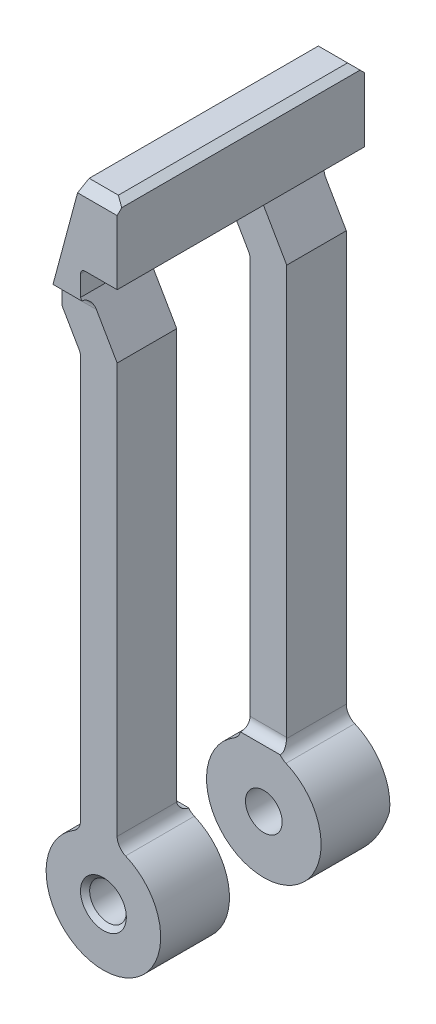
from build123d import *

# Parameters (mm, degrees)
ESQUISSE1_R             = 4
BASE_EXTRUSION_DEPTH    = 54
ENL_V_MAT_EXTRU_4_DEPTH = 25
CHANFREIN1_SIZE         = 1
CHANFREIN2_SIZE         = 2


with BuildPart() as part:
    # Esquisse1 → Base-Extrusion (new body)
    with BuildSketch(Plane.XY):
        with BuildLine():
            Line((-5, 13.275918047), (-5, 101.064101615))
            ThreePointArc((-5, 101.064101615), (-5.068148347, 101.581739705), (-5.267949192, 102.064101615))
            Line((-5.267949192, 102.064101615), (-9, 108.52820323))
            Line((-9, 108.52820323), (-9, 113.6))
            Line((-9, 113.6), (-3.105117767, 135.6))
            Line((-3.105117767, 135.6), (3.267949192, 135.6))
            Line((3.267949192, 135.6), (5, 134.6))
            Line((5, 134.6), (5, 119.6))
            Line((5, 119.6), (-2, 119.6))
            ThreePointArc((-2, 119.6), (-2.707106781, 119.307106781), (-3, 118.6))
            Line((-3, 118.6), (-3, 114.135898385))
            Line((-3, 114.135898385), (3, 103.743593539))
            Line((3, 103.743593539), (3, 14.291605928))
            ThreePointArc((3, 14.291605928), (3.501613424, 12.63086377), (4.838709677, 11.525488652))
            ThreePointArc((4.838709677, 11.525488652), (0.904486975, -12.467233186), (-6.451612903, 10.706385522))
            ThreePointArc((-6.451612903, 10.706385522), (-5.387992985, 11.800309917), (-5, 13.275918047))
        make_face()
        with Locations(Location((0, 0, 0), (0, 0, 180))):
            Circle(ESQUISSE1_R, mode=Mode.SUBTRACT)
    extrude(amount=BASE_EXTRUSION_DEPTH)

    # Esquisse4 → Enl_v. mat.-Extru.4 (cut, symmetric)
    with BuildSketch(Plane.ZY.offset(5)):
        with BuildLine():
            Line((52, 111.6), (52, -12.5))
            Line((52, -12.5), (37, -12.5))
            Line((37, -12.5), (37, 12.5))
            ThreePointArc((37, 12.5), (38.414213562, 13.085786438), (39, 14.5))
            Line((39, 14.5), (39, 113.6))
            Line((39, 113.6), (15, 113.6))
            Line((15, 113.6), (15, 14.5))
            ThreePointArc((15, 14.5), (15.585786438, 13.085786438), (17, 12.5))
            Line((17, 12.5), (17, -12.5))
            Line((17, -12.5), (5, -12.5))
            Line((5, -12.5), (2, -1.303847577))
            Line((2, -1.303847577), (2, 111.6))
            ThreePointArc((2, 111.6), (1.414213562, 113.014213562), (0, 113.6))
            Line((0, 113.6), (-15.1, 113.6))
            Line((-15.1, 113.6), (-15.1, -33))
            Line((-15.1, -33), (67, -33))
            Line((67, -33), (67, 113.6))
            Line((67, 113.6), (54, 113.6))
            ThreePointArc((54, 113.6), (52.585786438, 113.014213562), (52, 111.6))
        make_face()
    extrude(amount=ENL_V_MAT_EXTRU_4_DEPTH, both=True, mode=Mode.SUBTRACT)

    # Chanfrein1
    chanfrein1_edges = [part.edges().sort_by_distance(p)[0] for p in [
        (4, 0, 52),
    ]]
    chamfer(chanfrein1_edges, length=CHANFREIN1_SIZE)

    # Chanfrein2
    chanfrein2_edges = [part.edges().sort_by_distance(p)[0] for p in [
        (0.081415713, 135.6, 54),
        (0.081415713, 135.6, 0),
    ]]
    chamfer(chanfrein2_edges, length=CHANFREIN2_SIZE)


solid = part.part
